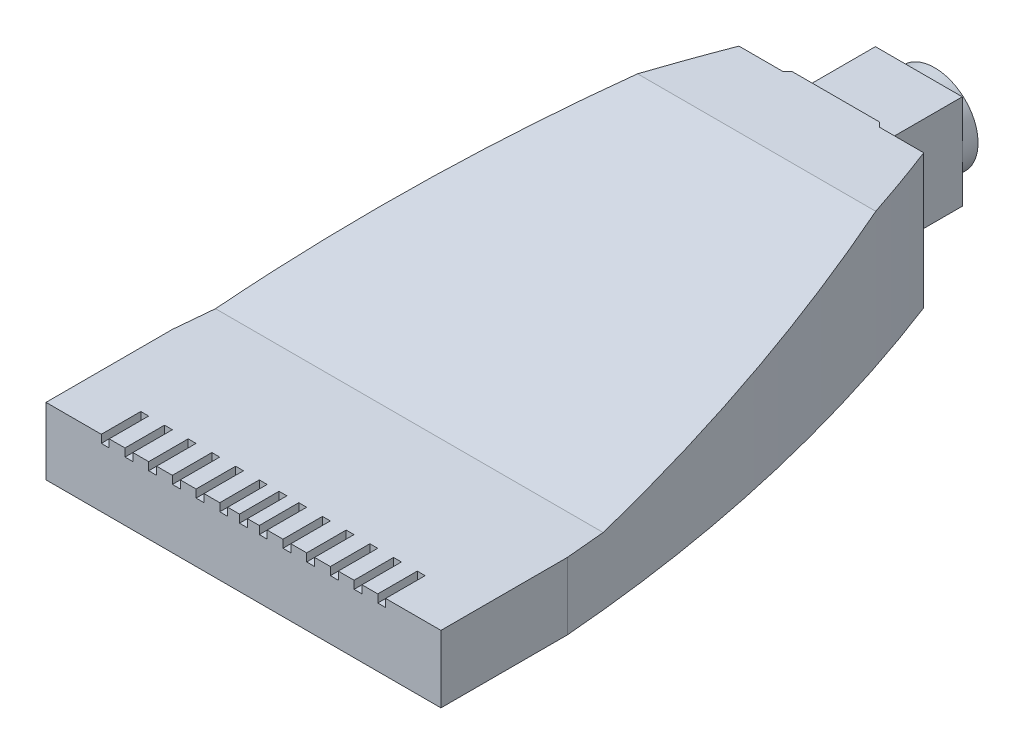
from build123d import *

# Parameters (mm, degrees)
ESTRUSIONE_ESTRUSIONE1_DEPTH = 17
SCHIZZO3_W                   = 16
SCHIZZO3_H                   = 8.5
TAGLIO_ESTRUSIONE2_DEPTH     = 80
SCHIZZO4_W                   = 10.5
SCHIZZO4_H                   = 2.5
TAGLIO_ESTRUSIONE4_DEPTH     = 11
SCHIZZO5_R                   = 5.5
ESTRUSIONE_ESTRUSIONE2_DEPTH = 2
SCHIZZO6_W                   = 1
SCHIZZO6_H                   = 5
SCHIZZO6_W_2                 = 0.5
TAGLIO_ESTRUSIONE5_DEPTH     = 1


with BuildPart() as part:
    # Schizzo1 → Estrusione-Estrusione1 (new body)
    with BuildSketch(Plane(origin=(0, 0, 0), x_dir=(1, 0, 0), z_dir=(0, 1, 0))):
        with BuildLine():
            Line((-25.5, -7.940684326), (-25.5, -23.940684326))
            Line((-25.5, -23.940684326), (24.5, -23.940684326))
            Line((24.5, -23.940684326), (24.5, -7.940684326))
            add(Edge.make_bspline(
                [(24.5, -7.940684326), (22.065033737, 22.226764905), (11.194702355, 50.482324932)],
                knots=[0, 0, 0, 1, 1, 1], degree=2))
            Line((11.194702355, 50.482324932), (5.576990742, 50.482324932))
            Line((5.576990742, 50.482324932), (5, 51.059315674))
            Line((5, 51.059315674), (5, 61.559315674))
            Line((5, 61.559315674), (-6, 61.559315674))
            Line((-6, 61.559315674), (-6, 51.059315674))
            Line((-6, 51.059315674), (-6.576990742, 50.482324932))
            Line((-6.576990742, 50.482324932), (-12.194702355, 50.482324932))
            add(Edge.make_bspline(
                [(-25.5, -7.940684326), (-23.065033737, 22.226764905), (-12.194702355, 50.482324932)],
                knots=[0, 0, 0, 1, 1, 1], degree=2))
        make_face()
    extrude(amount=ESTRUSIONE_ESTRUSIONE1_DEPTH)

    # Schizzo3 → Taglio-Estrusione2 (cut)
    with BuildSketch(Plane(origin=(24.5, 0, 0), x_dir=(0, 0, -1), z_dir=(1, 0, 0))):
        Polygon((-7.940684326, 17), (-7.940684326, 8.5), (-2.941465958, 8.5), (41.027097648, 17), align=None)
        with Locations((-15.940684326, 12.75)):
            Rectangle(SCHIZZO3_W, SCHIZZO3_H)
    extrude(amount=-TAGLIO_ESTRUSIONE2_DEPTH, mode=Mode.SUBTRACT)

    # Schizzo4 → Taglio-Estrusione4 (cut)
    with BuildSketch(Plane(origin=(5, 0, 0), x_dir=(0, 0, -1), z_dir=(1, 0, 0))):
        with Locations((56.309315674, 15.75)):
            Rectangle(SCHIZZO4_W, SCHIZZO4_H)
        with Locations((56.309315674, 1.25)):
            Rectangle(SCHIZZO4_W, SCHIZZO4_H)
    extrude(amount=-TAGLIO_ESTRUSIONE4_DEPTH, mode=Mode.SUBTRACT)

    # Schizzo5 → Estrusione-Estrusione2 (add)
    with BuildSketch(Plane(origin=(0, 0, -61.559315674), x_dir=(-1, 0, 0), z_dir=(0, 0, -1))):
        with Locations((0.5, 8.443251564)):
            Circle(SCHIZZO5_R)
    extrude(amount=ESTRUSIONE_ESTRUSIONE2_DEPTH)

    # Schizzo6 → Taglio-Estrusione5 (cut)
    with BuildSketch(Plane(origin=(0, 8.5, 0), x_dir=(1, 0, 0), z_dir=(0, 1, 0))):
        with Locations((-18, -21.440684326)):
            Rectangle(SCHIZZO6_W, SCHIZZO6_H)
        with Locations((-15, -21.440684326)):
            Rectangle(SCHIZZO6_W, SCHIZZO6_H)
        with Locations((-12, -21.440684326)):
            Rectangle(SCHIZZO6_W, SCHIZZO6_H)
        with Locations((-9, -21.440684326)):
            Rectangle(SCHIZZO6_W, SCHIZZO6_H)
        with Locations((-6, -21.440684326)):
            Rectangle(SCHIZZO6_W, SCHIZZO6_H)
        with Locations((-3, -21.440684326)):
            Rectangle(SCHIZZO6_W, SCHIZZO6_H)
        with Locations((-0.25, -21.440684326)):
            Rectangle(SCHIZZO6_W_2, SCHIZZO6_H)
        with Locations((-0.75, -21.440684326)):
            Rectangle(SCHIZZO6_W_2, SCHIZZO6_H)
        with Locations((2, -21.440684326)):
            Rectangle(SCHIZZO6_W, SCHIZZO6_H)
        with Locations((5, -21.440684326)):
            Rectangle(SCHIZZO6_W, SCHIZZO6_H)
        with Locations((8, -21.440684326)):
            Rectangle(SCHIZZO6_W, SCHIZZO6_H)
        with Locations((11, -21.440684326)):
            Rectangle(SCHIZZO6_W, SCHIZZO6_H)
        with Locations((14, -21.440684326)):
            Rectangle(SCHIZZO6_W, SCHIZZO6_H)
        with Locations((17, -21.440684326)):
            Rectangle(SCHIZZO6_W, SCHIZZO6_H)
    extrude(amount=-TAGLIO_ESTRUSIONE5_DEPTH, mode=Mode.SUBTRACT)


solid = part.part
